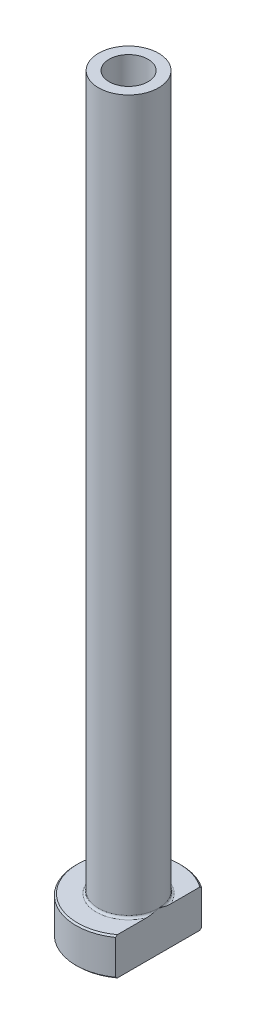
ISO-10303-21;
HEADER;
FILE_DESCRIPTION(('STEP AP214'),'2;1');
FILE_NAME('part.step','',(''),(''),'','','');
FILE_SCHEMA(('AUTOMOTIVE_DESIGN { 1 0 10303 214 1 1 1 1 }'));
ENDSEC;
DATA;
#1=APPLICATION_CONTEXT('core data for automotive mechanical design processes');
#2=APPLICATION_PROTOCOL_DEFINITION('international standard','automotive_design',2000,#1);
#3=PRODUCT_CONTEXT('',#1,'mechanical');
#4=PRODUCT('Part','Part','',(#3));
#5=PRODUCT_RELATED_PRODUCT_CATEGORY('part','',(#4));
#6=PRODUCT_DEFINITION_FORMATION('','',#4);
#7=PRODUCT_DEFINITION_CONTEXT('part definition',#1,'design');
#8=PRODUCT_DEFINITION('design','',#6,#7);
#9=PRODUCT_DEFINITION_SHAPE('','',#8);
#10=(LENGTH_UNIT() NAMED_UNIT(*) SI_UNIT(.MILLI.,.METRE.));
#11=(NAMED_UNIT(*) PLANE_ANGLE_UNIT() SI_UNIT($,.RADIAN.));
#12=(NAMED_UNIT(*) SI_UNIT($,.STERADIAN.) SOLID_ANGLE_UNIT());
#13=UNCERTAINTY_MEASURE_WITH_UNIT(LENGTH_MEASURE(1.E-05),#10,'distance_accuracy_value','');
#14=(GEOMETRIC_REPRESENTATION_CONTEXT(3) GLOBAL_UNCERTAINTY_ASSIGNED_CONTEXT((#13)) GLOBAL_UNIT_ASSIGNED_CONTEXT((#10,
#11,#12)) REPRESENTATION_CONTEXT('',''));
#15=CARTESIAN_POINT('',(0.,0.,0.));
#16=DIRECTION('',(0.,0.,1.));
#17=DIRECTION('',(1.,0.,0.));
#18=AXIS2_PLACEMENT_3D('',#15,#16,#17);
#19=CARTESIAN_POINT('',(0.,92.1876809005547,0.));
#20=DIRECTION('',(0.,1.,0.));
#21=DIRECTION('',(0.,0.,1.));
#22=AXIS2_PLACEMENT_3D('',#19,#20,#21);
#23=CYLINDRICAL_SURFACE('',#22,2.59999999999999);
#24=CARTESIAN_POINT('',(0.,100.,0.));
#25=DIRECTION('',(0.,1.,0.));
#26=DIRECTION('',(0.,0.,1.));
#27=AXIS2_PLACEMENT_3D('',#24,#25,#26);
#28=CIRCLE('',#27,2.59999999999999);
#29=CARTESIAN_POINT('',(0.,100.,2.59999999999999));
#30=VERTEX_POINT('',#29);
#31=EDGE_CURVE('E167',#30,#30,#28,.T.);
#32=ORIENTED_EDGE('',*,*,#31,.T.);
#33=EDGE_LOOP('',(#32));
#34=FACE_BOUND('',#33,.T.);
#35=CARTESIAN_POINT('',(0.,55.,0.));
#36=DIRECTION('',(0.,1.,0.));
#37=DIRECTION('',(0.,0.,1.));
#38=AXIS2_PLACEMENT_3D('',#35,#36,#37);
#39=CIRCLE('',#38,2.59999999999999);
#40=CARTESIAN_POINT('',(0.,55.,2.59999999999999));
#41=VERTEX_POINT('',#40);
#42=EDGE_CURVE('E170',#41,#41,#39,.T.);
#43=ORIENTED_EDGE('',*,*,#42,.F.);
#44=EDGE_LOOP('',(#43));
#45=FACE_BOUND('',#44,.T.);
#46=ADVANCED_FACE('F32',(#34,#45),#23,.F.);
#47=CARTESIAN_POINT('',(-2.59999999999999,100.,0.));
#48=DIRECTION('',(0.,1.,0.));
#49=DIRECTION('',(0.,0.,1.));
#50=AXIS2_PLACEMENT_3D('',#47,#48,#49);
#51=PLANE('',#50);
#52=CARTESIAN_POINT('',(0.,100.,0.));
#53=DIRECTION('',(0.,1.,0.));
#54=DIRECTION('',(0.,0.,1.));
#55=AXIS2_PLACEMENT_3D('',#52,#53,#54);
#56=CIRCLE('',#55,4.);
#57=CARTESIAN_POINT('',(0.,100.,4.));
#58=VERTEX_POINT('',#57);
#59=EDGE_CURVE('E174',#58,#58,#56,.T.);
#60=ORIENTED_EDGE('',*,*,#59,.T.);
#61=EDGE_LOOP('',(#60));
#62=FACE_BOUND('',#61,.T.);
#63=ORIENTED_EDGE('',*,*,#31,.F.);
#64=EDGE_LOOP('',(#63));
#65=FACE_BOUND('',#64,.T.);
#66=ADVANCED_FACE('F157',(#62,#65),#51,.T.);
#67=CARTESIAN_POINT('',(0.,92.1876809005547,0.));
#68=DIRECTION('',(0.,1.,0.));
#69=DIRECTION('',(0.,0.,1.));
#70=AXIS2_PLACEMENT_3D('',#67,#68,#69);
#71=CYLINDRICAL_SURFACE('',#70,4.);
#72=CARTESIAN_POINT('',(0.,5.3,0.));
#73=DIRECTION('',(0.,1.,0.));
#74=DIRECTION('',(0.,0.,1.));
#75=AXIS2_PLACEMENT_3D('',#72,#73,#74);
#76=CIRCLE('',#75,4.);
#77=CARTESIAN_POINT('',(4.,5.3,0.));
#78=VERTEX_POINT('',#77);
#79=EDGE_CURVE('E180',#78,#78,#76,.T.);
#80=ORIENTED_EDGE('',*,*,#79,.T.);
#81=EDGE_LOOP('',(#80));
#82=FACE_BOUND('',#81,.T.);
#83=ORIENTED_EDGE('',*,*,#59,.F.);
#84=EDGE_LOOP('',(#83));
#85=FACE_BOUND('',#84,.T.);
#86=ADVANCED_FACE('F162',(#82,#85),#71,.T.);
#87=CARTESIAN_POINT('',(-3.99999999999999,5.,0.));
#88=DIRECTION('',(0.,1.,0.));
#89=DIRECTION('',(0.,0.,1.));
#90=AXIS2_PLACEMENT_3D('',#87,#88,#89);
#91=PLANE('',#90);
#92=DIRECTION('',(0.,0.,1.));
#93=VECTOR('',#92,1.);
#94=CARTESIAN_POINT('',(4.,5.,0.));
#95=LINE('',#94,#93);
#96=CARTESIAN_POINT('',(4.,5.,-5.499090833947));
#97=VERTEX_POINT('',#96);
#98=CARTESIAN_POINT('',(4.,5.,-1.57797338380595));
#99=VERTEX_POINT('',#98);
#100=EDGE_CURVE('E54',#97,#99,#95,.T.);
#101=ORIENTED_EDGE('',*,*,#100,.F.);
#102=CARTESIAN_POINT('',(0.,5.,0.));
#103=DIRECTION('',(0.,1.,0.));
#104=DIRECTION('',(0.,0.,1.));
#105=AXIS2_PLACEMENT_3D('',#102,#103,#104);
#106=CIRCLE('',#105,6.79999999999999);
#107=CARTESIAN_POINT('',(3.99999999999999,5.,5.499090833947));
#108=VERTEX_POINT('',#107);
#109=EDGE_CURVE('E186',#97,#108,#106,.T.);
#110=ORIENTED_EDGE('',*,*,#109,.T.);
#111=CARTESIAN_POINT('',(4.,5.,1.57797338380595));
#112=VERTEX_POINT('',#111);
#113=EDGE_CURVE('E134',#112,#108,#95,.T.);
#114=ORIENTED_EDGE('',*,*,#113,.F.);
#115=CARTESIAN_POINT('',(0.,5.,0.));
#116=DIRECTION('',(0.,1.,0.));
#117=DIRECTION('',(0.,0.,1.));
#118=AXIS2_PLACEMENT_3D('',#115,#116,#117);
#119=CIRCLE('',#118,4.3);
#120=EDGE_CURVE('E183',#112,#99,#119,.F.);
#121=ORIENTED_EDGE('',*,*,#120,.T.);
#122=EDGE_LOOP('',(#101,#110,#114,#121));
#123=FACE_BOUND('',#122,.T.);
#124=ADVANCED_FACE('F197',(#123),#91,.T.);
#125=CARTESIAN_POINT('',(0.,92.1876809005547,0.));
#126=DIRECTION('',(0.,1.,0.));
#127=DIRECTION('',(0.,0.,1.));
#128=AXIS2_PLACEMENT_3D('',#125,#126,#127);
#129=CYLINDRICAL_SURFACE('',#128,6.99999999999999);
#130=DIRECTION('',(0.,-1.,0.));
#131=VECTOR('',#130,1.);
#132=CARTESIAN_POINT('',(3.99999999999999,100.,5.74456264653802));
#133=LINE('',#132,#131);
#134=CARTESIAN_POINT('',(3.99999999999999,4.8,5.74456264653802));
#135=VERTEX_POINT('',#134);
#136=CARTESIAN_POINT('',(3.99999999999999,0.199999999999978,5.74456264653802));
#137=VERTEX_POINT('',#136);
#138=EDGE_CURVE('E82',#135,#137,#133,.T.);
#139=ORIENTED_EDGE('',*,*,#138,.F.);
#140=CARTESIAN_POINT('',(0.,4.8,0.));
#141=DIRECTION('',(0.,1.,0.));
#142=DIRECTION('',(0.,0.,1.));
#143=AXIS2_PLACEMENT_3D('',#140,#141,#142);
#144=CIRCLE('',#143,6.99999999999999);
#145=CARTESIAN_POINT('',(4.,4.8,-5.74456264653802));
#146=VERTEX_POINT('',#145);
#147=EDGE_CURVE('E95',#135,#146,#144,.F.);
#148=ORIENTED_EDGE('',*,*,#147,.T.);
#149=DIRECTION('',(0.,-1.,0.));
#150=VECTOR('',#149,1.);
#151=CARTESIAN_POINT('',(4.,100.,-5.74456264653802));
#152=LINE('',#151,#150);
#153=CARTESIAN_POINT('',(4.,0.199999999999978,-5.74456264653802));
#154=VERTEX_POINT('',#153);
#155=EDGE_CURVE('E192',#146,#154,#152,.T.);
#156=ORIENTED_EDGE('',*,*,#155,.T.);
#157=CARTESIAN_POINT('',(0.,0.199999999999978,0.));
#158=DIRECTION('',(0.,-1.,0.));
#159=DIRECTION('',(0.,0.,-1.));
#160=AXIS2_PLACEMENT_3D('',#157,#158,#159);
#161=CIRCLE('',#160,6.99999999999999);
#162=EDGE_CURVE('E98',#154,#137,#161,.F.);
#163=ORIENTED_EDGE('',*,*,#162,.T.);
#164=EDGE_LOOP('',(#139,#148,#156,#163));
#165=FACE_BOUND('',#164,.T.);
#166=ADVANCED_FACE('F190',(#165),#129,.T.);
#167=CARTESIAN_POINT('',(-6.99999999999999,0.,0.));
#168=DIRECTION('',(0.,-1.,0.));
#169=DIRECTION('',(0.,0.,-1.));
#170=AXIS2_PLACEMENT_3D('',#167,#168,#169);
#171=PLANE('',#170);
#172=CARTESIAN_POINT('',(0.,0.,0.));
#173=DIRECTION('',(0.,-1.,0.));
#174=DIRECTION('',(0.,0.,-1.));
#175=AXIS2_PLACEMENT_3D('',#172,#173,#174);
#176=CIRCLE('',#175,3.34999999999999);
#177=CARTESIAN_POINT('',(0.,0.,-3.34999999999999));
#178=VERTEX_POINT('',#177);
#179=EDGE_CURVE('E40',#178,#178,#176,.F.);
#180=ORIENTED_EDGE('',*,*,#179,.T.);
#181=EDGE_LOOP('',(#180));
#182=FACE_BOUND('',#181,.T.);
#183=DIRECTION('',(0.,0.,-1.));
#184=VECTOR('',#183,1.);
#185=CARTESIAN_POINT('',(3.99999999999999,0.,5.74456264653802));
#186=LINE('',#185,#184);
#187=CARTESIAN_POINT('',(3.99999999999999,0.,5.49909083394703));
#188=VERTEX_POINT('',#187);
#189=CARTESIAN_POINT('',(4.,0.,-5.49909083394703));
#190=VERTEX_POINT('',#189);
#191=EDGE_CURVE('E47',#188,#190,#186,.T.);
#192=ORIENTED_EDGE('',*,*,#191,.F.);
#193=CARTESIAN_POINT('',(0.,0.,0.));
#194=DIRECTION('',(0.,-1.,0.));
#195=DIRECTION('',(0.,0.,-1.));
#196=AXIS2_PLACEMENT_3D('',#193,#194,#195);
#197=CIRCLE('',#196,6.80000000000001);
#198=EDGE_CURVE('E92',#188,#190,#197,.T.);
#199=ORIENTED_EDGE('',*,*,#198,.T.);
#200=EDGE_LOOP('',(#192,#199));
#201=FACE_BOUND('',#200,.T.);
#202=ADVANCED_FACE('F91',(#182,#201),#171,.T.);
#203=CARTESIAN_POINT('',(0.,92.1876809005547,0.));
#204=DIRECTION('',(0.,1.,0.));
#205=DIRECTION('',(0.,0.,1.));
#206=AXIS2_PLACEMENT_3D('',#203,#204,#205);
#207=CYLINDRICAL_SURFACE('',#206,2.84999999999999);
#208=CARTESIAN_POINT('',(0.,0.5,0.));
#209=DIRECTION('',(0.,-1.,0.));
#210=DIRECTION('',(0.,0.,-1.));
#211=AXIS2_PLACEMENT_3D('',#208,#209,#210);
#212=CIRCLE('',#211,2.84999999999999);
#213=CARTESIAN_POINT('',(0.,0.5,-2.84999999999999));
#214=VERTEX_POINT('',#213);
#215=EDGE_CURVE('E11',#214,#214,#212,.T.);
#216=ORIENTED_EDGE('',*,*,#215,.T.);
#217=EDGE_LOOP('',(#216));
#218=FACE_BOUND('',#217,.T.);
#219=CARTESIAN_POINT('',(0.,43.,0.));
#220=DIRECTION('',(0.,1.,0.));
#221=DIRECTION('',(0.,0.,1.));
#222=AXIS2_PLACEMENT_3D('',#219,#220,#221);
#223=CIRCLE('',#222,2.85);
#224=CARTESIAN_POINT('',(0.,43.,2.85));
#225=VERTEX_POINT('',#224);
#226=EDGE_CURVE('E172',#225,#225,#223,.T.);
#227=ORIENTED_EDGE('',*,*,#226,.T.);
#228=EDGE_LOOP('',(#227));
#229=FACE_BOUND('',#228,.T.);
#230=ADVANCED_FACE('F215',(#218,#229),#207,.F.);
#231=CARTESIAN_POINT('',(0.,43.,0.));
#232=DIRECTION('',(0.,-1.,0.));
#233=DIRECTION('',(0.,0.,-1.));
#234=AXIS2_PLACEMENT_3D('',#231,#232,#233);
#235=CONICAL_SURFACE('',#234,2.85,0.0208303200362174);
#236=ORIENTED_EDGE('',*,*,#42,.T.);
#237=EDGE_LOOP('',(#236));
#238=FACE_BOUND('',#237,.T.);
#239=ORIENTED_EDGE('',*,*,#226,.F.);
#240=EDGE_LOOP('',(#239));
#241=FACE_BOUND('',#240,.T.);
#242=ADVANCED_FACE('F111',(#238,#241),#235,.F.);
#243=CARTESIAN_POINT('',(0.,5.3,0.));
#244=DIRECTION('',(0.,1.,0.));
#245=DIRECTION('',(0.,0.,1.));
#246=AXIS2_PLACEMENT_3D('',#243,#244,#245);
#247=TOROIDAL_SURFACE('',#246,4.3,0.3);
#248=ORIENTED_EDGE('',*,*,#120,.F.);
#249=CARTESIAN_POINT('',(4.,5.3,0.));
#250=CARTESIAN_POINT('',(4.,5.30000062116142,-1.06250722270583E-10));
#251=CARTESIAN_POINT('',(4.,5.30000124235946,2.17726018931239E-07));
#252=CARTESIAN_POINT('',(4.,5.30000240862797,8.3614089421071E-07));
#253=CARTESIAN_POINT('',(4.,5.30000294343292,1.25011668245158E-06));
#254=CARTESIAN_POINT('',(4.,5.30000404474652,2.2395931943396E-06));
#255=CARTESIAN_POINT('',(4.,5.30000459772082,2.83084440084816E-06));
#256=CARTESIAN_POINT('',(4.,5.30000559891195,4.06516578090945E-06));
#257=CARTESIAN_POINT('',(4.,5.30000604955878,4.70640059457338E-06));
#258=CARTESIAN_POINT('',(4.,5.30000769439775,7.15677166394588E-06));
#259=CARTESIAN_POINT('',(4.,5.30000879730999,9.02995921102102E-06));
#260=CARTESIAN_POINT('',(4.,5.30001063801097,1.27664881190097E-05));
#261=CARTESIAN_POINT('',(4.,5.30001139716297,1.46197801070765E-05));
#262=CARTESIAN_POINT('',(4.,5.30001453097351,2.23679212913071E-05));
#263=CARTESIAN_POINT('',(4.,5.30001683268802,2.82968736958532E-05));
#264=CARTESIAN_POINT('',(4.,5.30002027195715,3.95668715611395E-05));
#265=CARTESIAN_POINT('',(4.,5.30002152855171,4.48715448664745E-05));
#266=CARTESIAN_POINT('',(4.,5.30003060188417,8.40118178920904E-05));
#267=CARTESIAN_POINT('',(4.,5.30003739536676,0.000118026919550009));
#268=CARTESIAN_POINT('',(4.,5.30006713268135,0.000252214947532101));
#269=CARTESIAN_POINT('',(4.,5.30009559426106,0.000351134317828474));
#270=CARTESIAN_POINT('',(4.,5.3002062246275,0.00074247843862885));
#271=CARTESIAN_POINT('',(4.,5.30028475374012,0.00103561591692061));
#272=CARTESIAN_POINT('',(4.,5.30059889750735,0.0021992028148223));
#273=CARTESIAN_POINT('',(4.,5.30083905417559,0.00306873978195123));
#274=CARTESIAN_POINT('',(4.,5.3018368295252,0.00669141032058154));
#275=CARTESIAN_POINT('',(4.,5.30258877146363,0.00944568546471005));
#276=CARTESIAN_POINT('',(4.,5.31066890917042,0.039029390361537));
#277=CARTESIAN_POINT('',(4.,5.31802631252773,0.0658531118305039));
#278=CARTESIAN_POINT('',(4.,5.33239676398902,0.118441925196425));
#279=CARTESIAN_POINT('',(4.,5.33941183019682,0.144206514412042));
#280=CARTESIAN_POINT('',(4.,5.35427366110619,0.199017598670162));
#281=CARTESIAN_POINT('',(4.,5.36211313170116,0.228066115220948));
#282=CARTESIAN_POINT('',(4.,5.37776349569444,0.286511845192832));
#283=CARTESIAN_POINT('',(4.,5.38557313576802,0.31590939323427));
#284=CARTESIAN_POINT('',(4.,5.40425662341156,0.386994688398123));
#285=CARTESIAN_POINT('',(4.,5.41505237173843,0.428703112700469));
#286=CARTESIAN_POINT('',(4.,5.43592310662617,0.511098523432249));
#287=CARTESIAN_POINT('',(4.,5.44600969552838,0.551782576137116));
#288=CARTESIAN_POINT('',(4.,5.4785098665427,0.686599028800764));
#289=CARTESIAN_POINT('',(4.,5.4997837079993,0.781011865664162));
#290=CARTESIAN_POINT('',(4.,5.53807543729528,0.971847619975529));
#291=CARTESIAN_POINT('',(4.,5.55504273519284,1.06828120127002));
#292=CARTESIAN_POINT('',(4.,5.57582405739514,1.21752725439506));
#293=CARTESIAN_POINT('',(4.,5.58209796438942,1.26999379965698));
#294=CARTESIAN_POINT('',(4.,5.59210686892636,1.37516324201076));
#295=CARTESIAN_POINT('',(4.,5.59584265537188,1.42786606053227));
#296=CARTESIAN_POINT('',(4.,5.60010438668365,1.53310673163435));
#297=CARTESIAN_POINT('',(4.,5.6006487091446,1.5856437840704));
#298=CARTESIAN_POINT('',(4.,5.59767158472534,1.69058605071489));
#299=CARTESIAN_POINT('',(4.,5.59415502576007,1.74299134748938));
#300=CARTESIAN_POINT('',(4.,5.58503062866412,1.81903290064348));
#301=CARTESIAN_POINT('',(4.,5.58157617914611,1.84292934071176));
#302=CARTESIAN_POINT('',(4.,5.57329952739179,1.89051061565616));
#303=CARTESIAN_POINT('',(4.,5.56847619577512,1.91419525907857));
#304=CARTESIAN_POINT('',(4.,5.55726644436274,1.96092888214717));
#305=CARTESIAN_POINT('',(4.,5.55089740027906,1.98398195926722));
#306=CARTESIAN_POINT('',(4.,5.53623434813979,2.02945550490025));
#307=CARTESIAN_POINT('',(4.,5.52794253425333,2.05187666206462));
#308=CARTESIAN_POINT('',(4.,5.50887098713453,2.09590631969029));
#309=CARTESIAN_POINT('',(4.,5.49806837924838,2.11750508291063));
#310=CARTESIAN_POINT('',(4.,5.47333401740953,2.15885583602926));
#311=CARTESIAN_POINT('',(4.,5.45941272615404,2.17861369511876));
#312=CARTESIAN_POINT('',(4.,5.43588221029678,2.20522942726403));
#313=CARTESIAN_POINT('',(4.,5.42781139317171,2.2134404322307));
#314=CARTESIAN_POINT('',(4.,5.41065114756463,2.2287514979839));
#315=CARTESIAN_POINT('',(4.,5.40156129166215,2.23585108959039));
#316=CARTESIAN_POINT('',(4.,5.38220524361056,2.2485969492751));
#317=CARTESIAN_POINT('',(4.,5.37192420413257,2.25422119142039));
#318=CARTESIAN_POINT('',(4.,5.35045072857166,2.2633106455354));
#319=CARTESIAN_POINT('',(4.,5.33926122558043,2.26678251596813));
#320=CARTESIAN_POINT('',(4.,5.31952044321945,2.27051268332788));
#321=CARTESIAN_POINT('',(4.,5.3110845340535,2.27139016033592));
#322=CARTESIAN_POINT('',(4.,5.29418624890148,2.2716896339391));
#323=CARTESIAN_POINT('',(4.,5.28572387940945,2.27111196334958));
#324=CARTESIAN_POINT('',(4.,5.26904138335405,2.26855580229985));
#325=CARTESIAN_POINT('',(4.,5.26082066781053,2.26658107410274));
#326=CARTESIAN_POINT('',(4.,5.24478214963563,2.26139496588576));
#327=CARTESIAN_POINT('',(4.,5.23696461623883,2.25818277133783));
#328=CARTESIAN_POINT('',(4.,5.21851235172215,2.24908332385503));
#329=CARTESIAN_POINT('',(4.,5.20815219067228,2.24264095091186));
#330=CARTESIAN_POINT('',(4.,5.18857975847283,2.22819957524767));
#331=CARTESIAN_POINT('',(4.,5.17937061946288,2.2201964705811));
#332=CARTESIAN_POINT('',(4.,5.15665383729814,2.19777756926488));
#333=CARTESIAN_POINT('',(4.,5.14403484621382,2.18246908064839));
#334=CARTESIAN_POINT('',(4.,5.12118369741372,2.15020843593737));
#335=CARTESIAN_POINT('',(4.,5.11095480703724,2.13325407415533));
#336=CARTESIAN_POINT('',(4.,5.09273574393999,2.09892324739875));
#337=CARTESIAN_POINT('',(4.,5.08468212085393,2.08157988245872));
#338=CARTESIAN_POINT('',(4.,5.07005901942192,2.04627072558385));
#339=CARTESIAN_POINT('',(4.,5.06349101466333,2.02830433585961));
#340=CARTESIAN_POINT('',(4.,5.04555485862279,1.97350761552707));
#341=CARTESIAN_POINT('',(4.,5.03608974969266,1.93605770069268));
#342=CARTESIAN_POINT('',(4.,5.01780569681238,1.84529235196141));
#343=CARTESIAN_POINT('',(4.,5.01077018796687,1.79164082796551));
#344=CARTESIAN_POINT('',(4.,5.00182846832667,1.68379947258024));
#345=CARTESIAN_POINT('',(4.,4.99993887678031,1.62960846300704));
#346=CARTESIAN_POINT('',(4.,5.00006129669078,1.52361204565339));
#347=CARTESIAN_POINT('',(4.,5.0019069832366,1.47180551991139));
#348=CARTESIAN_POINT('',(4.,5.0084124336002,1.36835357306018));
#349=CARTESIAN_POINT('',(4.,5.01307376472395,1.31670825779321));
#350=CARTESIAN_POINT('',(4.,5.02905484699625,1.17431887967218));
#351=CARTESIAN_POINT('',(4.,5.04274090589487,1.08384207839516));
#352=CARTESIAN_POINT('',(4.,5.06701714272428,0.947757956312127));
#353=CARTESIAN_POINT('',(4.,5.07585573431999,0.901814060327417));
#354=CARTESIAN_POINT('',(4.,5.09458665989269,0.810008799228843));
#355=CARTESIAN_POINT('',(4.,5.1044818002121,0.764148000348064));
#356=CARTESIAN_POINT('',(4.,5.12892434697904,0.655631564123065));
#357=CARTESIAN_POINT('',(4.,5.14383556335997,0.593058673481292));
#358=CARTESIAN_POINT('',(4.,5.17458762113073,0.468885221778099));
#359=CARTESIAN_POINT('',(4.,5.19041623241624,0.407281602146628));
#360=CARTESIAN_POINT('',(4.,5.22090834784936,0.29123270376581));
#361=CARTESIAN_POINT('',(4.,5.23550024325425,0.236768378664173));
#362=CARTESIAN_POINT('',(4.,5.26562550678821,0.125604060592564));
#363=CARTESIAN_POINT('',(4.,5.28117250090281,0.0689076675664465));
#364=CARTESIAN_POINT('',(4.,5.29741226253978,0.0094415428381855));
#365=CARTESIAN_POINT('',(4.,5.29816540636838,0.00668315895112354));
#366=CARTESIAN_POINT('',(4.,5.29916346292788,0.00305954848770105));
#367=CARTESIAN_POINT('',(4.,5.29940273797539,0.00219318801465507));
#368=CARTESIAN_POINT('',(4.,5.2997158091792,0.00103357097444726));
#369=CARTESIAN_POINT('',(4.,5.29979412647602,0.00074122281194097));
#370=CARTESIAN_POINT('',(4.,5.29990450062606,0.000350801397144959));
#371=CARTESIAN_POINT('',(4.,5.29993292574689,0.000252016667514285));
#372=CARTESIAN_POINT('',(4.,5.29996263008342,0.000117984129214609));
#373=CARTESIAN_POINT('',(4.,5.29996941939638,8.39881862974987E-05));
#374=CARTESIAN_POINT('',(4.,5.29997848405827,4.48673992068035E-05));
#375=CARTESIAN_POINT('',(4.,5.29997973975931,3.95638164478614E-05));
#376=CARTESIAN_POINT('',(4.,5.29998317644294,2.8296031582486E-05));
#377=CARTESIAN_POINT('',(4.,5.2999854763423,2.23681438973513E-05));
#378=CARTESIAN_POINT('',(4.,5.29998860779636,1.46210990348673E-05));
#379=CARTESIAN_POINT('',(4.,5.29998936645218,1.27678887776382E-05));
#380=CARTESIAN_POINT('',(4.,5.29999120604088,9.03143944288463E-06));
#381=CARTESIAN_POINT('',(4.,5.29999230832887,7.15824000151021E-06));
#382=CARTESIAN_POINT('',(4.,5.29999395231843,4.70775467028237E-06));
#383=CARTESIAN_POINT('',(4.,5.29999440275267,4.06646329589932E-06));
#384=CARTESIAN_POINT('',(4.,5.29999540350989,2.83199042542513E-06));
#385=CARTESIAN_POINT('',(4.,5.29999595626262,2.24064306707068E-06));
#386=CARTESIAN_POINT('',(4.,5.29999705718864,1.25093947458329E-06));
#387=CARTESIAN_POINT('',(4.,5.2999975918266,8.36840866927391E-07));
#388=CARTESIAN_POINT('',(4.,5.29999875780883,2.18117657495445E-07));
#389=CARTESIAN_POINT('',(4.,5.29999937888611,1.06243800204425E-10));
#390=CARTESIAN_POINT('',(4.,5.3,0.));
#391=B_SPLINE_CURVE_WITH_KNOTS('',3,(#249,#250,#251,#252,#253,#254,#255,#256,#257,#258,#259,
#260,#261,#262,#263,#264,#265,#266,#267,#268,#269,#270,#271,#272,#273,#274,#275,#276,#277,#278,
#279,#280,#281,#282,#283,#284,#285,#286,#287,#288,#289,#290,#291,#292,#293,#294,#295,#296,#297,
#298,#299,#300,#301,#302,#303,#304,#305,#306,#307,#308,#309,#310,#311,#312,#313,#314,#315,#316,
#317,#318,#319,#320,#321,#322,#323,#324,#325,#326,#327,#328,#329,#330,#331,#332,#333,#334,#335,
#336,#337,#338,#339,#340,#341,#342,#343,#344,#345,#346,#347,#348,#349,#350,#351,#352,#353,#354,
#355,#356,#357,#358,#359,#360,#361,#362,#363,#364,#365,#366,#367,#368,#369,#370,#371,#372,#373,
#374,#375,#376,#377,#378,#379,#380,#381,#382,#383,#384,#385,#386,#387,#388,#389,#390),
.UNSPECIFIED.,.T.,.F.,(4,2,2,2,2,2,2,2,2,2,2,2,2,2,2,2,2,2,2,2,2,2,2,2,2,2,2,2,2,2,2,2,2,2,2,2,
2,2,2,2,2,2,2,2,2,2,2,2,2,2,2,2,2,2,2,2,2,2,2,2,2,2,2,2,2,2,2,2,2,2,4),(0.,1.87484528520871E-06,
3.90180232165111E-06,6.31684114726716E-06,8.6665232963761E-06,1.51627596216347E-05,
2.11657986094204E-05,4.02090827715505E-05,5.65429538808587E-05,0.00016062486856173,
0.000469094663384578,0.001379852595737,0.00408571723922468,0.0126514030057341,
0.0960918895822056,0.176200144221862,0.266463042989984,0.357714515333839,0.486961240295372,
0.612707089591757,0.902988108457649,1.19653589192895,1.35501075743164,1.51343634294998,
1.67094875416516,1.82827177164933,1.90067591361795,1.97313996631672,2.04482437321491,
2.11642737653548,2.18871023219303,2.26075412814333,2.29521947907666,2.32969934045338,
2.36466792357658,2.39952778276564,2.42485422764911,2.45017488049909,2.47542760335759,
2.50069697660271,2.53708899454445,2.57357798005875,2.63276032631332,2.6920231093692,
2.749303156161,2.80663977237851,2.92223125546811,3.08420752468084,3.24670629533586,
3.40212850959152,3.55763731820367,3.83192962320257,3.97228382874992,4.11302057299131,
4.30598130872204,4.49678885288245,4.66594443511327,4.84230602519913,4.85088453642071,
4.8535805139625,4.8544888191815,4.85479687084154,4.85490089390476,4.85491722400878,
4.85493626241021,4.85494226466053,4.85494875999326,4.85495110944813,4.85495352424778,
4.85495555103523,4.85495742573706),.UNSPECIFIED.);
#392=EDGE_CURVE('E126',#112,#78,#391,.T.);
#393=ORIENTED_EDGE('',*,*,#392,.T.);
#394=ORIENTED_EDGE('',*,*,#79,.F.);
#395=CARTESIAN_POINT('',(4.,5.3,0.));
#396=CARTESIAN_POINT('',(4.,5.29999937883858,1.06251755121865E-10));
#397=CARTESIAN_POINT('',(4.,5.29999875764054,-2.17726017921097E-07));
#398=CARTESIAN_POINT('',(4.,5.29999759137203,-8.36140893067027E-07));
#399=CARTESIAN_POINT('',(4.,5.29999705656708,-1.25011668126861E-06));
#400=CARTESIAN_POINT('',(4.,5.29999595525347,-2.23959319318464E-06));
#401=CARTESIAN_POINT('',(4.,5.29999540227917,-2.83084439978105E-06));
#402=CARTESIAN_POINT('',(4.,5.29999440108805,-4.06516577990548E-06));
#403=CARTESIAN_POINT('',(4.,5.29999395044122,-4.706400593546E-06));
#404=CARTESIAN_POINT('',(4.,5.29999230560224,-7.15677166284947E-06));
#405=CARTESIAN_POINT('',(3.99999999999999,5.29999120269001,-9.02995920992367E-06));
#406=CARTESIAN_POINT('',(3.99999999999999,5.29998936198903,-1.2766488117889E-05));
#407=CARTESIAN_POINT('',(4.,5.29998860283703,-1.46197801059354E-05));
#408=CARTESIAN_POINT('',(4.,5.29998546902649,-2.23679212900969E-05));
#409=CARTESIAN_POINT('',(4.,5.29998316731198,-2.82968736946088E-05));
#410=CARTESIAN_POINT('',(4.,5.29997972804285,-3.95668715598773E-05));
#411=CARTESIAN_POINT('',(4.,5.29997847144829,-4.48715448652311E-05));
#412=CARTESIAN_POINT('',(4.,5.29996939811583,-8.40118178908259E-05));
#413=CARTESIAN_POINT('',(4.,5.29996260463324,-0.000118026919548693));
#414=CARTESIAN_POINT('',(3.99999999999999,5.29993286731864,-0.000252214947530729));
#415=CARTESIAN_POINT('',(4.,5.29990440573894,-0.000351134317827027));
#416=CARTESIAN_POINT('',(4.,5.2997937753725,-0.000742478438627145));
#417=CARTESIAN_POINT('',(4.,5.29971524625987,-0.00103561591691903));
#418=CARTESIAN_POINT('',(3.99999999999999,5.29940110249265,-0.00219920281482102));
#419=CARTESIAN_POINT('',(3.99999999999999,5.29916094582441,-0.00306873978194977));
#420=CARTESIAN_POINT('',(4.,5.2981631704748,-0.00669141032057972));
#421=CARTESIAN_POINT('',(4.,5.29741122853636,-0.0094456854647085));
#422=CARTESIAN_POINT('',(3.99999999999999,5.28933109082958,-0.039029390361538));
#423=CARTESIAN_POINT('',(3.99999999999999,5.28197368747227,-0.0658531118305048));
#424=CARTESIAN_POINT('',(4.,5.26760323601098,-0.118441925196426));
#425=CARTESIAN_POINT('',(4.,5.26058816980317,-0.144206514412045));
#426=CARTESIAN_POINT('',(3.99999999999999,5.24572633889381,-0.199017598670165));
#427=CARTESIAN_POINT('',(4.,5.23788686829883,-0.22806611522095));
#428=CARTESIAN_POINT('',(4.,5.22223650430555,-0.286511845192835));
#429=CARTESIAN_POINT('',(4.,5.21442686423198,-0.315909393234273));
#430=CARTESIAN_POINT('',(4.,5.19574337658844,-0.386994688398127));
#431=CARTESIAN_POINT('',(4.,5.18494762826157,-0.428703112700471));
#432=CARTESIAN_POINT('',(4.,5.16407689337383,-0.511098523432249));
#433=CARTESIAN_POINT('',(4.,5.15399030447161,-0.551782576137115));
#434=CARTESIAN_POINT('',(4.,5.12149013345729,-0.686599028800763));
#435=CARTESIAN_POINT('',(4.,5.1002162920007,-0.781011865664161));
#436=CARTESIAN_POINT('',(4.,5.06192456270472,-0.971847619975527));
#437=CARTESIAN_POINT('',(4.,5.04495726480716,-1.06828120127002));
#438=CARTESIAN_POINT('',(4.,5.02417594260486,-1.21752725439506));
#439=CARTESIAN_POINT('',(4.,5.01790203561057,-1.26999379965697));
#440=CARTESIAN_POINT('',(4.,5.00789313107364,-1.37516324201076));
#441=CARTESIAN_POINT('',(4.,5.00415734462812,-1.42786606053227));
#442=CARTESIAN_POINT('',(4.,4.99989561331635,-1.53310673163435));
#443=CARTESIAN_POINT('',(4.,4.9993512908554,-1.5856437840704));
#444=CARTESIAN_POINT('',(4.,5.00232841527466,-1.69058605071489));
#445=CARTESIAN_POINT('',(4.,5.00584497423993,-1.74299134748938));
#446=CARTESIAN_POINT('',(4.,5.01496937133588,-1.81903290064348));
#447=CARTESIAN_POINT('',(4.,5.01842382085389,-1.84292934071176));
#448=CARTESIAN_POINT('',(4.,5.02670047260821,-1.89051061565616));
#449=CARTESIAN_POINT('',(4.,5.03152380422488,-1.91419525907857));
#450=CARTESIAN_POINT('',(4.,5.04273355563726,-1.96092888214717));
#451=CARTESIAN_POINT('',(4.,5.04910259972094,-1.98398195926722));
#452=CARTESIAN_POINT('',(4.,5.0637656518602,-2.02945550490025));
#453=CARTESIAN_POINT('',(4.,5.07205746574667,-2.05187666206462));
#454=CARTESIAN_POINT('',(4.,5.09112901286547,-2.09590631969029));
#455=CARTESIAN_POINT('',(4.,5.10193162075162,-2.11750508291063));
#456=CARTESIAN_POINT('',(4.,5.12666598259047,-2.15885583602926));
#457=CARTESIAN_POINT('',(4.,5.14058727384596,-2.17861369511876));
#458=CARTESIAN_POINT('',(4.,5.16411778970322,-2.20522942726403));
#459=CARTESIAN_POINT('',(4.,5.17218860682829,-2.2134404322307));
#460=CARTESIAN_POINT('',(4.,5.18934885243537,-2.2287514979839));
#461=CARTESIAN_POINT('',(4.,5.19843870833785,-2.23585108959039));
#462=CARTESIAN_POINT('',(4.,5.21779475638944,-2.2485969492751));
#463=CARTESIAN_POINT('',(4.,5.22807579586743,-2.25422119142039));
#464=CARTESIAN_POINT('',(4.,5.24954927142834,-2.2633106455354));
#465=CARTESIAN_POINT('',(4.,5.26073877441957,-2.26678251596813));
#466=CARTESIAN_POINT('',(4.,5.28047955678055,-2.27051268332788));
#467=CARTESIAN_POINT('',(4.,5.2889154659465,-2.27139016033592));
#468=CARTESIAN_POINT('',(4.,5.30581375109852,-2.2716896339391));
#469=CARTESIAN_POINT('',(4.,5.31427612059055,-2.27111196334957));
#470=CARTESIAN_POINT('',(4.,5.33095861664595,-2.26855580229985));
#471=CARTESIAN_POINT('',(4.,5.33917933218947,-2.26658107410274));
#472=CARTESIAN_POINT('',(4.,5.35521785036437,-2.26139496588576));
#473=CARTESIAN_POINT('',(4.,5.36303538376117,-2.25818277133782));
#474=CARTESIAN_POINT('',(4.,5.38148764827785,-2.24908332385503));
#475=CARTESIAN_POINT('',(4.,5.39184780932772,-2.24264095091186));
#476=CARTESIAN_POINT('',(4.,5.41142024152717,-2.22819957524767));
#477=CARTESIAN_POINT('',(4.,5.42062938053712,-2.2201964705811));
#478=CARTESIAN_POINT('',(4.,5.44334616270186,-2.19777756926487));
#479=CARTESIAN_POINT('',(4.,5.45596515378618,-2.18246908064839));
#480=CARTESIAN_POINT('',(4.,5.47881630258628,-2.15020843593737));
#481=CARTESIAN_POINT('',(4.,5.48904519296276,-2.13325407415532));
#482=CARTESIAN_POINT('',(4.,5.50726425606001,-2.09892324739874));
#483=CARTESIAN_POINT('',(4.,5.51531787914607,-2.08157988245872));
#484=CARTESIAN_POINT('',(4.,5.52994098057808,-2.04627072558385));
#485=CARTESIAN_POINT('',(4.,5.53650898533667,-2.02830433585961));
#486=CARTESIAN_POINT('',(4.,5.55444514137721,-1.97350761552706));
#487=CARTESIAN_POINT('',(4.,5.56391025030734,-1.93605770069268));
#488=CARTESIAN_POINT('',(4.,5.58219430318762,-1.8452923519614));
#489=CARTESIAN_POINT('',(4.,5.58922981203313,-1.79164082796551));
#490=CARTESIAN_POINT('',(4.,5.59817153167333,-1.68379947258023));
#491=CARTESIAN_POINT('',(4.,5.60006112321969,-1.62960846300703));
#492=CARTESIAN_POINT('',(4.,5.59993870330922,-1.52361204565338));
#493=CARTESIAN_POINT('',(4.,5.5980930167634,-1.47180551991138));
#494=CARTESIAN_POINT('',(4.,5.5915875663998,-1.36835357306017));
#495=CARTESIAN_POINT('',(4.,5.58692623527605,-1.31670825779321));
#496=CARTESIAN_POINT('',(4.,5.57094515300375,-1.17431887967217));
#497=CARTESIAN_POINT('',(4.,5.55725909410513,-1.08384207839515));
#498=CARTESIAN_POINT('',(4.,5.53298285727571,-0.947757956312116));
#499=CARTESIAN_POINT('',(4.,5.52414426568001,-0.901814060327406));
#500=CARTESIAN_POINT('',(4.,5.5054133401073,-0.810008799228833));
#501=CARTESIAN_POINT('',(4.,5.4955181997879,-0.764148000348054));
#502=CARTESIAN_POINT('',(4.,5.47107565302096,-0.655631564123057));
#503=CARTESIAN_POINT('',(4.,5.45616443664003,-0.593058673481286));
#504=CARTESIAN_POINT('',(4.,5.42541237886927,-0.468885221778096));
#505=CARTESIAN_POINT('',(3.99999999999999,5.40958376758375,-0.407281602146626));
#506=CARTESIAN_POINT('',(4.,5.37909165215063,-0.291232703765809));
#507=CARTESIAN_POINT('',(4.,5.36449975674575,-0.236768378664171));
#508=CARTESIAN_POINT('',(3.99999999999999,5.33437449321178,-0.125604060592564));
#509=CARTESIAN_POINT('',(3.99999999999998,5.31882749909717,-0.0689076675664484));
#510=CARTESIAN_POINT('',(4.,5.30258773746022,-0.00944154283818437));
#511=CARTESIAN_POINT('',(4.,5.30183459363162,-0.00668315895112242));
#512=CARTESIAN_POINT('',(3.99999999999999,5.30083653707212,-0.00305954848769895));
#513=CARTESIAN_POINT('',(3.99999999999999,5.30059726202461,-0.00219318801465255));
#514=CARTESIAN_POINT('',(4.,5.30028419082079,-0.00103357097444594));
#515=CARTESIAN_POINT('',(4.,5.30020587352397,-0.000741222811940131));
#516=CARTESIAN_POINT('',(4.,5.30009549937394,-0.000350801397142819));
#517=CARTESIAN_POINT('',(3.99999999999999,5.30006707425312,-0.000252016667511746));
#518=CARTESIAN_POINT('',(4.,5.30003736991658,-0.000117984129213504));
#519=CARTESIAN_POINT('',(4.,5.30003058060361,-8.39881862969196E-05));
#520=CARTESIAN_POINT('',(4.,5.30002151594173,-4.48673992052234E-05));
#521=CARTESIAN_POINT('',(4.,5.30002026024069,-3.95638164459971E-05));
#522=CARTESIAN_POINT('',(4.,5.30001682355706,-2.82960315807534E-05));
#523=CARTESIAN_POINT('',(4.,5.3000145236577,-2.23681438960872E-05));
#524=CARTESIAN_POINT('',(4.,5.30001139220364,-1.46210990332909E-05));
#525=CARTESIAN_POINT('',(3.99999999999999,5.30001063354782,-1.27678887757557E-05));
#526=CARTESIAN_POINT('',(3.99999999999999,5.30000879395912,-9.03143944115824E-06));
#527=CARTESIAN_POINT('',(4.,5.30000769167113,-7.15824000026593E-06));
#528=CARTESIAN_POINT('',(4.,5.30000604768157,-4.70775466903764E-06));
#529=CARTESIAN_POINT('',(4.,5.30000559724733,-4.0664632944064E-06));
#530=CARTESIAN_POINT('',(4.,5.30000459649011,-2.83199042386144E-06));
#531=CARTESIAN_POINT('',(4.,5.30000404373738,-2.24064306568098E-06));
#532=CARTESIAN_POINT('',(4.,5.30000294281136,-1.25093947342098E-06));
#533=CARTESIAN_POINT('',(4.,5.30000240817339,-8.36840865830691E-07));
#534=CARTESIAN_POINT('',(4.,5.30000124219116,-2.18117656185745E-07));
#535=CARTESIAN_POINT('',(4.,5.30000062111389,-1.06242417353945E-10));
#536=CARTESIAN_POINT('',(4.,5.3,0.));
#537=B_SPLINE_CURVE_WITH_KNOTS('',3,(#395,#396,#397,#398,#399,#400,#401,#402,#403,#404,#405,
#406,#407,#408,#409,#410,#411,#412,#413,#414,#415,#416,#417,#418,#419,#420,#421,#422,#423,#424,
#425,#426,#427,#428,#429,#430,#431,#432,#433,#434,#435,#436,#437,#438,#439,#440,#441,#442,#443,
#444,#445,#446,#447,#448,#449,#450,#451,#452,#453,#454,#455,#456,#457,#458,#459,#460,#461,#462,
#463,#464,#465,#466,#467,#468,#469,#470,#471,#472,#473,#474,#475,#476,#477,#478,#479,#480,#481,
#482,#483,#484,#485,#486,#487,#488,#489,#490,#491,#492,#493,#494,#495,#496,#497,#498,#499,#500,
#501,#502,#503,#504,#505,#506,#507,#508,#509,#510,#511,#512,#513,#514,#515,#516,#517,#518,#519,
#520,#521,#522,#523,#524,#525,#526,#527,#528,#529,#530,#531,#532,#533,#534,#535,#536),
.UNSPECIFIED.,.T.,.F.,(4,2,2,2,2,2,2,2,2,2,2,2,2,2,2,2,2,2,2,2,2,2,2,2,2,2,2,2,2,2,2,2,2,2,2,2,
2,2,2,2,2,2,2,2,2,2,2,2,2,2,2,2,2,2,2,2,2,2,2,2,2,2,2,2,2,2,2,2,2,2,4),(0.,1.87484528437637E-06,
3.90180232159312E-06,6.31684114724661E-06,8.66652329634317E-06,1.51627596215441E-05,
2.11657986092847E-05,4.02090827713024E-05,5.65429538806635E-05,0.000160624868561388,
0.000469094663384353,0.00137985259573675,0.00408571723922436,0.0126514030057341,
0.0960918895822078,0.176200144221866,0.266463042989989,0.357714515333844,0.486961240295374,
0.612707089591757,0.902988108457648,1.19653589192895,1.35501075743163,1.51343634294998,
1.67094875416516,1.82827177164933,1.90067591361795,1.97313996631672,2.04482437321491,
2.11642737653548,2.18871023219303,2.26075412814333,2.29521947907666,2.32969934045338,
2.36466792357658,2.39952778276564,2.42485422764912,2.45017488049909,2.47542760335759,
2.50069697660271,2.53708899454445,2.57357798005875,2.63276032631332,2.6920231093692,
2.74930315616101,2.80663977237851,2.92223125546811,3.08420752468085,3.24670629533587,
3.40212850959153,3.55763731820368,3.83192962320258,3.97228382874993,4.11302057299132,
4.30598130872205,4.49678885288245,4.66594443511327,4.84230602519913,4.85088453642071,
4.8535805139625,4.8544888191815,4.85479687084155,4.85490089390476,4.85491722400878,
4.85493626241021,4.85494226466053,4.85494875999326,4.85495110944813,4.85495352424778,
4.85495555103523,4.85495742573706),.UNSPECIFIED.);
#538=EDGE_CURVE('E135',#78,#99,#537,.T.);
#539=ORIENTED_EDGE('',*,*,#538,.T.);
#540=EDGE_LOOP('',(#248,#393,#394,#539));
#541=FACE_BOUND('',#540,.T.);
#542=ADVANCED_FACE('F141',(#541),#247,.F.);
#543=CARTESIAN_POINT('',(0.,5.,0.));
#544=DIRECTION('',(0.,-1.,0.));
#545=DIRECTION('',(0.,0.,-1.));
#546=AXIS2_PLACEMENT_3D('',#543,#544,#545);
#547=CONICAL_SURFACE('',#546,6.79999999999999,0.78539816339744);
#548=CARTESIAN_POINT('',(4.,-1.45712845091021,-12.6392822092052));
#549=CARTESIAN_POINT('',(4.,-1.24364466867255,-12.4153556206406));
#550=CARTESIAN_POINT('',(4.,-1.03042430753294,-12.1911774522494));
#551=CARTESIAN_POINT('',(4.,-0.604617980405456,-11.7422167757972));
#552=CARTESIAN_POINT('',(4.,-0.392032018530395,-11.5174342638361));
#553=CARTESIAN_POINT('',(4.,0.0324624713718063,-11.0670952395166));
#554=CARTESIAN_POINT('',(4.,0.244370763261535,-10.8415385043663));
#555=CARTESIAN_POINT('',(4.,0.667290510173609,-10.3895875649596));
#556=CARTESIAN_POINT('',(4.,0.878301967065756,-10.1631933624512));
#557=CARTESIAN_POINT('',(4.,1.51385375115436,-9.47810122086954));
#558=CARTESIAN_POINT('',(4.,1.93676291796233,-9.01788214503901));
#559=CARTESIAN_POINT('',(4.,2.56612335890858,-8.32309905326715));
#560=CARTESIAN_POINT('',(4.,2.77505666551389,-8.09078457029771));
#561=CARTESIAN_POINT('',(4.,3.19080254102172,-7.62426940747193));
#562=CARTESIAN_POINT('',(4.,3.39761512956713,-7.39006874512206));
#563=CARTESIAN_POINT('',(4.,3.87870763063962,-6.83891844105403));
#564=CARTESIAN_POINT('',(4.,4.15190978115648,-6.52102188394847));
#565=CARTESIAN_POINT('',(4.,4.55642425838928,-6.0396090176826));
#566=CARTESIAN_POINT('',(4.,4.69041050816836,-5.87833992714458));
#567=CARTESIAN_POINT('',(4.,4.95616531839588,-5.55398469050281));
#568=CARTESIAN_POINT('',(4.,5.08793391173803,-5.39089857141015));
#569=CARTESIAN_POINT('',(4.,5.34841712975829,-5.06288801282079));
#570=CARTESIAN_POINT('',(4.,5.47713786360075,-4.89796843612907));
#571=CARTESIAN_POINT('',(4.,5.73107494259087,-4.56545535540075));
#572=CARTESIAN_POINT('',(4.,5.85629144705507,-4.3978619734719));
#573=CARTESIAN_POINT('',(4.,6.10211465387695,-4.05948444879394));
#574=CARTESIAN_POINT('',(4.,6.22272435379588,-3.88870249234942));
#575=CARTESIAN_POINT('',(4.,6.45796076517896,-3.54308312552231));
#576=CARTESIAN_POINT('',(4.,6.57258867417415,-3.36824653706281));
#577=CARTESIAN_POINT('',(4.,6.76866603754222,-3.05381396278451));
#578=CARTESIAN_POINT('',(4.,6.85173773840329,-2.91523359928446));
#579=CARTESIAN_POINT('',(4.,7.0117453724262,-2.63451965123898));
#580=CARTESIAN_POINT('',(4.,7.08868042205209,-2.49238555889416));
#581=CARTESIAN_POINT('',(4.,7.2345943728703,-2.20416961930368));
#582=CARTESIAN_POINT('',(4.,7.30357836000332,-2.05809037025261));
#583=CARTESIAN_POINT('',(4.,7.43135520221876,-1.76151732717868));
#584=CARTESIAN_POINT('',(4.,7.49015114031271,-1.61102488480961));
#585=CARTESIAN_POINT('',(4.,7.58249315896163,-1.34142099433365));
#586=CARTESIAN_POINT('',(4.,7.61872660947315,-1.22323501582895));
#587=CARTESIAN_POINT('',(4.,7.68223354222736,-0.984492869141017));
#588=CARTESIAN_POINT('',(4.,7.70951040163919,-0.863937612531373));
#589=CARTESIAN_POINT('',(4.,7.75377914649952,-0.621342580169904));
#590=CARTESIAN_POINT('',(4.,7.77080509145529,-0.499309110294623));
#591=CARTESIAN_POINT('',(4.,7.79378778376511,-0.254194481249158));
#592=CARTESIAN_POINT('',(4.,7.79974523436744,-0.131113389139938));
#593=CARTESIAN_POINT('',(4.,7.800239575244,0.115517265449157));
#594=CARTESIAN_POINT('',(4.,7.79473514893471,0.239066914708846));
#595=CARTESIAN_POINT('',(4.,7.77255119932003,0.485148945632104));
#596=CARTESIAN_POINT('',(4.,7.75587091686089,0.607681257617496));
#597=CARTESIAN_POINT('',(4.,7.71218353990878,0.851269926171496));
#598=CARTESIAN_POINT('',(4.,7.68514362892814,0.972320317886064));
#599=CARTESIAN_POINT('',(4.,7.62201202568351,1.21200276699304));
#600=CARTESIAN_POINT('',(4.,7.58591962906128,1.33063463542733));
#601=CARTESIAN_POINT('',(4.,7.45980070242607,1.70122439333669));
#602=CARTESIAN_POINT('',(4.,7.35572950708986,1.94843335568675));
#603=CARTESIAN_POINT('',(4.,7.18186715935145,2.31048534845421));
#604=CARTESIAN_POINT('',(4.,7.12087684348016,2.42983561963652));
#605=CARTESIAN_POINT('',(4.,6.99403531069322,2.66593629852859));
#606=CARTESIAN_POINT('',(3.99999999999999,6.92818466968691,2.7826870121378));
#607=CARTESIAN_POINT('',(3.99999999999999,6.79157875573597,3.01550895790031));
#608=CARTESIAN_POINT('',(3.99999999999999,6.72076681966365,3.1315466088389));
#609=CARTESIAN_POINT('',(3.99999999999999,6.575831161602,3.36153379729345));
#610=CARTESIAN_POINT('',(3.99999999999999,6.50170736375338,3.47548328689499));
#611=CARTESIAN_POINT('',(3.99999999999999,6.35080982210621,3.70145107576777));
#612=CARTESIAN_POINT('',(3.99999999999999,6.27403866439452,3.81347110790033));
#613=CARTESIAN_POINT('',(3.99999999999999,6.11824120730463,4.03592316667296));
#614=CARTESIAN_POINT('',(3.99999999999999,6.03921496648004,4.14635523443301));
#615=CARTESIAN_POINT('',(3.99999999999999,5.81506547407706,4.4539715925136));
#616=CARTESIAN_POINT('',(3.99999999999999,5.66782256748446,4.64961120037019));
#617=CARTESIAN_POINT('',(3.99999999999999,5.36880597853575,5.03740600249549));
#618=CARTESIAN_POINT('',(3.99999999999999,5.21703183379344,5.22956083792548));
#619=CARTESIAN_POINT('',(3.99999999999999,4.90999105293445,5.61115465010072));
#620=CARTESIAN_POINT('',(3.99999999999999,4.75472331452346,5.80059273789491));
#621=CARTESIAN_POINT('',(3.99999999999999,4.44150758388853,6.1772436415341));
#622=CARTESIAN_POINT('',(3.99999999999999,4.28355951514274,6.36445639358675));
#623=CARTESIAN_POINT('',(3.99999999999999,3.96525805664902,6.73740614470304));
#624=CARTESIAN_POINT('',(3.99999999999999,3.80490084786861,6.92313987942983));
#625=CARTESIAN_POINT('',(3.99999999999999,3.48247055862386,7.29311320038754));
#626=CARTESIAN_POINT('',(3.99999999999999,3.32039746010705,7.47735277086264));
#627=CARTESIAN_POINT('',(3.99999999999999,2.83216188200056,8.02814826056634));
#628=CARTESIAN_POINT('',(3.99999999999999,2.50391696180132,8.39285790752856));
#629=CARTESIAN_POINT('',(3.99999999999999,1.87512078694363,9.08414492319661));
#630=CARTESIAN_POINT('',(3.99999999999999,1.57491666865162,9.41103929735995));
#631=CARTESIAN_POINT('',(3.99999999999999,0.972153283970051,10.0626830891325));
#632=CARTESIAN_POINT('',(3.99999999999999,0.669593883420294,10.3874323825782));
#633=CARTESIAN_POINT('',(3.99999999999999,0.0637759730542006,11.0341169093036));
#634=CARTESIAN_POINT('',(3.99999999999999,-0.239476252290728,11.3560580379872));
#635=CARTESIAN_POINT('',(3.99999999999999,-0.847356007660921,11.9985921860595));
#636=CARTESIAN_POINT('',(3.99999999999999,-1.15198342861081,12.3191853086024));
#637=CARTESIAN_POINT('',(3.99999999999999,-1.45712845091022,12.6392822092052));
#638=B_SPLINE_CURVE_WITH_KNOTS('',3,(#548,#549,#550,#551,#552,#553,#554,#555,#556,#557,#558,
#559,#560,#561,#562,#563,#564,#565,#566,#567,#568,#569,#570,#571,#572,#573,#574,#575,#576,#577,
#578,#579,#580,#581,#582,#583,#584,#585,#586,#587,#588,#589,#590,#591,#592,#593,#594,#595,#596,
#597,#598,#599,#600,#601,#602,#603,#604,#605,#606,#607,#608,#609,#610,#611,#612,#613,#614,#615,
#616,#617,#618,#619,#620,#621,#622,#623,#624,#625,#626,#627,#628,#629,#630,#631,#632,#633,#634,
#635,#636,#637),.UNSPECIFIED.,.F.,.F.,(4,2,2,2,2,2,2,2,2,2,2,2,2,2,2,2,2,2,2,2,2,2,2,2,2,2,2,2,
2,2,2,2,2,2,2,2,2,2,2,2,2,2,2,2,4),(0.,0.928152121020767,1.8563102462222,2.78476262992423,
3.71321307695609,5.58823033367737,6.52556078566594,7.4628825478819,8.72028576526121,
9.34927045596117,9.97824580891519,10.6058302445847,11.2333861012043,11.860526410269,
12.4875406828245,12.9721363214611,13.4568016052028,13.9411551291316,14.4253618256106,
14.7959147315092,15.1663277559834,15.535503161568,15.9046551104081,16.2751400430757,
16.645650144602,17.017343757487,17.3890663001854,18.1913996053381,18.5934522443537,
18.9954573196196,19.4032100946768,19.8109722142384,20.218346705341,20.6257106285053,
21.3601838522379,22.0947322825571,22.8295158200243,23.5643203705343,24.3004480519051,
25.0365834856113,26.5085499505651,27.8400191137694,29.1715646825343,30.4983881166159,
31.8251080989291),.UNSPECIFIED.);
#639=EDGE_CURVE('E133',#146,#97,#638,.T.);
#640=ORIENTED_EDGE('',*,*,#639,.F.);
#641=ORIENTED_EDGE('',*,*,#147,.F.);
#642=EDGE_CURVE('E118',#108,#135,#638,.T.);
#643=ORIENTED_EDGE('',*,*,#642,.F.);
#644=ORIENTED_EDGE('',*,*,#109,.F.);
#645=EDGE_LOOP('',(#640,#641,#643,#644));
#646=FACE_BOUND('',#645,.T.);
#647=ADVANCED_FACE('F145',(#646),#547,.T.);
#648=CARTESIAN_POINT('',(0.,0.199999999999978,0.));
#649=DIRECTION('',(0.,1.,0.));
#650=DIRECTION('',(0.,0.,1.));
#651=AXIS2_PLACEMENT_3D('',#648,#649,#650);
#652=CONICAL_SURFACE('',#651,6.99999999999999,0.78539816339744);
#653=CARTESIAN_POINT('',(3.99999999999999,6.45712845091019,12.6392822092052));
#654=CARTESIAN_POINT('',(3.99999999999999,6.24364466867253,12.4153556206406));
#655=CARTESIAN_POINT('',(3.99999999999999,6.03042430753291,12.1911774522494));
#656=CARTESIAN_POINT('',(3.99999999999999,5.60461798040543,11.7422167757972));
#657=CARTESIAN_POINT('',(3.99999999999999,5.39203201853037,11.5174342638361));
#658=CARTESIAN_POINT('',(3.99999999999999,4.96753752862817,11.0670952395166));
#659=CARTESIAN_POINT('',(3.99999999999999,4.75562923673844,10.8415385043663));
#660=CARTESIAN_POINT('',(3.99999999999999,4.33270948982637,10.3895875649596));
#661=CARTESIAN_POINT('',(3.99999999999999,4.12169803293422,10.1631933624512));
#662=CARTESIAN_POINT('',(3.99999999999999,3.48614624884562,9.47810122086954));
#663=CARTESIAN_POINT('',(3.99999999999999,3.06323708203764,9.01788214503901));
#664=CARTESIAN_POINT('',(3.99999999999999,2.4338766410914,8.32309905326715));
#665=CARTESIAN_POINT('',(3.99999999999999,2.22494333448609,8.09078457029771));
#666=CARTESIAN_POINT('',(3.99999999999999,1.80919745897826,7.62426940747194));
#667=CARTESIAN_POINT('',(3.99999999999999,1.60238487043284,7.39006874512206));
#668=CARTESIAN_POINT('',(3.99999999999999,1.12129236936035,6.83891844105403));
#669=CARTESIAN_POINT('',(3.99999999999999,0.848090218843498,6.52102188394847));
#670=CARTESIAN_POINT('',(3.99999999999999,0.443575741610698,6.0396090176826));
#671=CARTESIAN_POINT('',(3.99999999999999,0.30958949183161,5.87833992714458));
#672=CARTESIAN_POINT('',(3.99999999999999,0.043834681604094,5.55398469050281));
#673=CARTESIAN_POINT('',(3.99999999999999,-0.087933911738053,5.39089857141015));
#674=CARTESIAN_POINT('',(3.99999999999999,-0.348417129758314,5.06288801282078));
#675=CARTESIAN_POINT('',(3.99999999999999,-0.477137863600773,4.89796843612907));
#676=CARTESIAN_POINT('',(3.99999999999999,-0.7310749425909,4.56545535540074));
#677=CARTESIAN_POINT('',(3.99999999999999,-0.856291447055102,4.3978619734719));
#678=CARTESIAN_POINT('',(3.99999999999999,-1.10211465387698,4.05948444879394));
#679=CARTESIAN_POINT('',(3.99999999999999,-1.22272435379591,3.88870249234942));
#680=CARTESIAN_POINT('',(3.99999999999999,-1.45796076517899,3.54308312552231));
#681=CARTESIAN_POINT('',(3.99999999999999,-1.57258867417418,3.3682465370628));
#682=CARTESIAN_POINT('',(3.99999999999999,-1.76866603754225,3.05381396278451));
#683=CARTESIAN_POINT('',(4.,-1.85173773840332,2.91523359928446));
#684=CARTESIAN_POINT('',(4.,-2.01174537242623,2.63451965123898));
#685=CARTESIAN_POINT('',(4.,-2.08868042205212,2.49238555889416));
#686=CARTESIAN_POINT('',(4.,-2.23459437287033,2.20416961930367));
#687=CARTESIAN_POINT('',(4.,-2.30357836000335,2.05809037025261));
#688=CARTESIAN_POINT('',(4.,-2.43135520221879,1.76151732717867));
#689=CARTESIAN_POINT('',(4.,-2.49015114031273,1.6110248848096));
#690=CARTESIAN_POINT('',(4.,-2.58249315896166,1.34142099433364));
#691=CARTESIAN_POINT('',(4.,-2.61872660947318,1.22323501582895));
#692=CARTESIAN_POINT('',(4.,-2.68223354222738,0.98449286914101));
#693=CARTESIAN_POINT('',(4.,-2.70951040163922,0.863937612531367));
#694=CARTESIAN_POINT('',(4.,-2.75377914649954,0.621342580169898));
#695=CARTESIAN_POINT('',(4.,-2.77080509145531,0.499309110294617));
#696=CARTESIAN_POINT('',(4.,-2.79378778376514,0.254194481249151));
#697=CARTESIAN_POINT('',(4.,-2.79974523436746,0.131113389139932));
#698=CARTESIAN_POINT('',(4.,-2.80023957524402,-0.115517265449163));
#699=CARTESIAN_POINT('',(4.,-2.79473514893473,-0.239066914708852));
#700=CARTESIAN_POINT('',(4.,-2.77255119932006,-0.485148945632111));
#701=CARTESIAN_POINT('',(4.,-2.75587091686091,-0.607681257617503));
#702=CARTESIAN_POINT('',(4.,-2.7121835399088,-0.851269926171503));
#703=CARTESIAN_POINT('',(4.,-2.68514362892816,-0.97232031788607));
#704=CARTESIAN_POINT('',(4.,-2.62201202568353,-1.21200276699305));
#705=CARTESIAN_POINT('',(4.,-2.58591962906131,-1.33063463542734));
#706=CARTESIAN_POINT('',(4.,-2.45980070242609,-1.7012243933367));
#707=CARTESIAN_POINT('',(4.,-2.35572950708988,-1.94843335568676));
#708=CARTESIAN_POINT('',(4.,-2.18186715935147,-2.31048534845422));
#709=CARTESIAN_POINT('',(4.,-2.12087684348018,-2.42983561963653));
#710=CARTESIAN_POINT('',(4.,-1.99403531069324,-2.6659362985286));
#711=CARTESIAN_POINT('',(4.,-1.92818466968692,-2.78268701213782));
#712=CARTESIAN_POINT('',(4.,-1.79157875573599,-3.01550895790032));
#713=CARTESIAN_POINT('',(4.,-1.72076681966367,-3.13154660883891));
#714=CARTESIAN_POINT('',(4.,-1.57583116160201,-3.36153379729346));
#715=CARTESIAN_POINT('',(4.,-1.5017073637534,-3.47548328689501));
#716=CARTESIAN_POINT('',(4.,-1.35080982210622,-3.70145107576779));
#717=CARTESIAN_POINT('',(4.,-1.27403866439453,-3.81347110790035));
#718=CARTESIAN_POINT('',(4.,-1.11824120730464,-4.03592316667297));
#719=CARTESIAN_POINT('',(4.,-1.03921496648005,-4.14635523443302));
#720=CARTESIAN_POINT('',(4.,-0.815065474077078,-4.45397159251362));
#721=CARTESIAN_POINT('',(4.,-0.667822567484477,-4.6496112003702));
#722=CARTESIAN_POINT('',(4.,-0.368805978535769,-5.0374060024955));
#723=CARTESIAN_POINT('',(4.,-0.21703183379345,-5.22956083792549));
#724=CARTESIAN_POINT('',(4.,0.0900089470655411,-5.61115465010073));
#725=CARTESIAN_POINT('',(4.,0.245276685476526,-5.80059273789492));
#726=CARTESIAN_POINT('',(4.,0.558492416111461,-6.17724364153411));
#727=CARTESIAN_POINT('',(4.,0.716440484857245,-6.36445639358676));
#728=CARTESIAN_POINT('',(4.,1.03474194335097,-6.73740614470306));
#729=CARTESIAN_POINT('',(4.,1.19509915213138,-6.92313987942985));
#730=CARTESIAN_POINT('',(4.,1.51752944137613,-7.29311320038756));
#731=CARTESIAN_POINT('',(4.,1.67960253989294,-7.47735277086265));
#732=CARTESIAN_POINT('',(4.,2.16783811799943,-8.02814826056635));
#733=CARTESIAN_POINT('',(4.,2.49608303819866,-8.39285790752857));
#734=CARTESIAN_POINT('',(4.,3.12487921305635,-9.08414492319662));
#735=CARTESIAN_POINT('',(4.,3.42508333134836,-9.41103929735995));
#736=CARTESIAN_POINT('',(4.,4.02784671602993,-10.0626830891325));
#737=CARTESIAN_POINT('',(4.,4.33040611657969,-10.3874323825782));
#738=CARTESIAN_POINT('',(4.,4.93622402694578,-11.0341169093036));
#739=CARTESIAN_POINT('',(4.,5.23947625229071,-11.3560580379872));
#740=CARTESIAN_POINT('',(4.,5.8473560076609,-11.9985921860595));
#741=CARTESIAN_POINT('',(4.,6.15198342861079,-12.3191853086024));
#742=CARTESIAN_POINT('',(4.,6.45712845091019,-12.6392822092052));
#743=B_SPLINE_CURVE_WITH_KNOTS('',3,(#653,#654,#655,#656,#657,#658,#659,#660,#661,#662,#663,
#664,#665,#666,#667,#668,#669,#670,#671,#672,#673,#674,#675,#676,#677,#678,#679,#680,#681,#682,
#683,#684,#685,#686,#687,#688,#689,#690,#691,#692,#693,#694,#695,#696,#697,#698,#699,#700,#701,
#702,#703,#704,#705,#706,#707,#708,#709,#710,#711,#712,#713,#714,#715,#716,#717,#718,#719,#720,
#721,#722,#723,#724,#725,#726,#727,#728,#729,#730,#731,#732,#733,#734,#735,#736,#737,#738,#739,
#740,#741,#742),.UNSPECIFIED.,.F.,.F.,(4,2,2,2,2,2,2,2,2,2,2,2,2,2,2,2,2,2,2,2,2,2,2,2,2,2,2,2,
2,2,2,2,2,2,2,2,2,2,2,2,2,2,2,2,4),(0.,0.928152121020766,1.8563102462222,2.78476262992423,
3.71321307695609,5.58823033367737,6.52556078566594,7.46288254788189,8.72028576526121,
9.34927045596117,9.97824580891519,10.6058302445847,11.2333861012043,11.860526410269,
12.4875406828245,12.9721363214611,13.4568016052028,13.9411551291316,14.4253618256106,
14.7959147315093,15.1663277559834,15.535503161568,15.9046551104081,16.2751400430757,
16.645650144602,17.017343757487,17.3890663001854,18.1913996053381,18.5934522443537,
18.9954573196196,19.4032100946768,19.8109722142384,20.218346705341,20.6257106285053,
21.3601838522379,22.0947322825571,22.8295158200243,23.5643203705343,24.3004480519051,
25.0365834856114,26.5085499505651,27.8400191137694,29.1715646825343,30.4983881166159,
31.8251080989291),.UNSPECIFIED.);
#744=EDGE_CURVE('E79',#137,#188,#743,.T.);
#745=ORIENTED_EDGE('',*,*,#744,.F.);
#746=ORIENTED_EDGE('',*,*,#162,.F.);
#747=EDGE_CURVE('E87',#190,#154,#743,.T.);
#748=ORIENTED_EDGE('',*,*,#747,.F.);
#749=ORIENTED_EDGE('',*,*,#198,.F.);
#750=EDGE_LOOP('',(#745,#746,#748,#749));
#751=FACE_BOUND('',#750,.T.);
#752=ADVANCED_FACE('F94',(#751),#652,.T.);
#753=CARTESIAN_POINT('',(3.99999999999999,100.,5.74456264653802));
#754=DIRECTION('',(-1.,0.,0.));
#755=DIRECTION('',(0.,0.,1.));
#756=AXIS2_PLACEMENT_3D('',#753,#754,#755);
#757=PLANE('',#756);
#758=ORIENTED_EDGE('',*,*,#392,.F.);
#759=ORIENTED_EDGE('',*,*,#113,.T.);
#760=ORIENTED_EDGE('',*,*,#642,.T.);
#761=ORIENTED_EDGE('',*,*,#138,.T.);
#762=ORIENTED_EDGE('',*,*,#744,.T.);
#763=ORIENTED_EDGE('',*,*,#191,.T.);
#764=ORIENTED_EDGE('',*,*,#747,.T.);
#765=ORIENTED_EDGE('',*,*,#155,.F.);
#766=ORIENTED_EDGE('',*,*,#639,.T.);
#767=ORIENTED_EDGE('',*,*,#100,.T.);
#768=ORIENTED_EDGE('',*,*,#538,.F.);
#769=EDGE_LOOP('',(#758,#759,#760,#761,#762,#763,#764,#765,#766,#767,#768));
#770=FACE_BOUND('',#769,.T.);
#771=ADVANCED_FACE('F80',(#770),#757,.F.);
#772=CARTESIAN_POINT('',(0.,0.,0.));
#773=DIRECTION('',(0.,-1.,0.));
#774=DIRECTION('',(0.,0.,-1.));
#775=AXIS2_PLACEMENT_3D('',#772,#773,#774);
#776=CONICAL_SURFACE('',#775,3.34999999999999,0.785398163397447);
#777=ORIENTED_EDGE('',*,*,#215,.F.);
#778=EDGE_LOOP('',(#777));
#779=FACE_BOUND('',#778,.T.);
#780=ORIENTED_EDGE('',*,*,#179,.F.);
#781=EDGE_LOOP('',(#780));
#782=FACE_BOUND('',#781,.T.);
#783=ADVANCED_FACE('F34',(#779,#782),#776,.F.);
#784=CLOSED_SHELL('',(#46,#66,#86,#124,#166,#202,#230,#242,#542,#647,#752,#771,#783));
#785=MANIFOLD_SOLID_BREP('B2',#784);
#786=ADVANCED_BREP_SHAPE_REPRESENTATION('',(#18,#785),#14);
#787=SHAPE_DEFINITION_REPRESENTATION(#9,#786);
ENDSEC;
END-ISO-10303-21;
